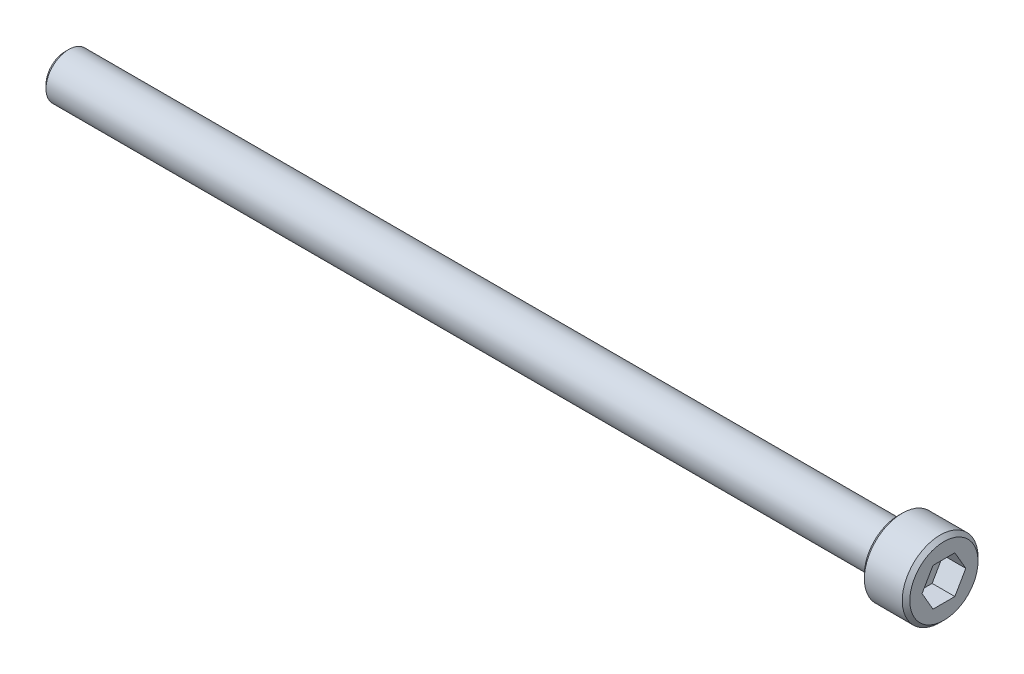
from build123d import *

# Parameters (mm, degrees)
ENL_V_MAT_EXTRU_1_DEPTH = 3
CHANFREIN2_SIZE         = 0.5


with BuildPart() as part:
    # Esquisse1 → R_volution1 (revolve)
    with BuildSketch(Plane.XY):
        Polygon((-116, 0), (-116, 3), (-6, 3), (-6, 5), (0, 5), (0, 0), align=None)
    revolve(axis=Axis((0, 0, 0), (-1, 0, 0)))

    # Esquisse2 → Enl_v. mat.-Extru.1 (cut)
    with BuildSketch(Plane(origin=(0, 0, 0), x_dir=(0, 0, -1), z_dir=(1, 0, 0))):
        Polygon((2.886751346, 0), (1.443375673, 2.5), (-1.443375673, 2.5), (-2.886751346, 0), (-1.443375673, -2.5), (1.443375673, -2.5), align=None)
    extrude(amount=-ENL_V_MAT_EXTRU_1_DEPTH, mode=Mode.SUBTRACT)

    # Chanfrein2
    chanfrein2_edges = [part.edges().sort_by_distance(p)[0] for p in [
        (0, -5, 0),
        (-6, -5, 0),
        (-116, -3, 0),
    ]]
    chamfer(chanfrein2_edges, length=CHANFREIN2_SIZE)


solid = part.part
